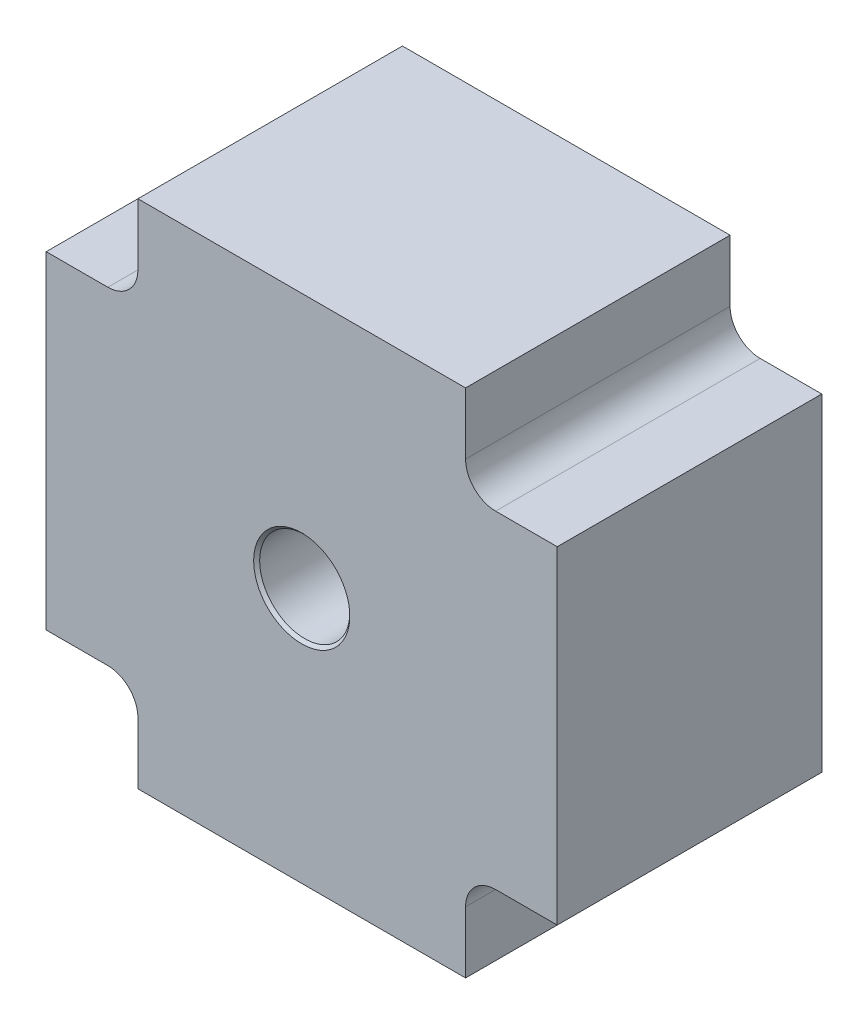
from build123d import *

# Parameters (mm, degrees)
EXTRUDE_1_DEPTH     = 44
SKETCH_3_R          = 7.5
CUT_EXTRUDE_2_DEPTH = 75.488254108
CHAMFER_3_SIZE      = 0.5
FILLET_1_R          = 5


with BuildPart() as part:
    # Sketch 1 → Extrude 1 (new body)
    with BuildSketch(Plane.XY):
        Polygon((27.25, 42.5), (-27.25, 42.5), (-27.25, 27.25), (-42.5, 27.25), (-42.5, -27.25), (-27.25, -27.25), (-27.25, -42.5), (27.25, -42.5), (27.25, -27.25), (42.5, -27.25), (42.5, 27.25), (27.25, 27.25), align=None)
    extrude(amount=EXTRUDE_1_DEPTH)

    # Sketch 3 → Cut-Extrude 2 (cut, through all)
    with BuildSketch(Plane.XY.offset(44)):
        Circle(SKETCH_3_R)
    extrude(amount=-CUT_EXTRUDE_2_DEPTH, mode=Mode.SUBTRACT)

    # Chamfer 3
    chamfer_3_edges = [part.edges().sort_by_distance(p)[0] for p in [
        (-7.5, 0, 0),
        (-7.5, 0, 44),
    ]]
    chamfer(chamfer_3_edges, length=CHAMFER_3_SIZE)

    # Fillet 1
    fillet_1_edges = [part.edges().sort_by_distance(p)[0] for p in [
        (-27.25, -27.25, 22),
        (-27.25, 27.25, 22),
        (27.25, 27.25, 22),
        (27.25, -27.25, 22),
    ]]
    fillet(fillet_1_edges, radius=FILLET_1_R)


solid = part.part
